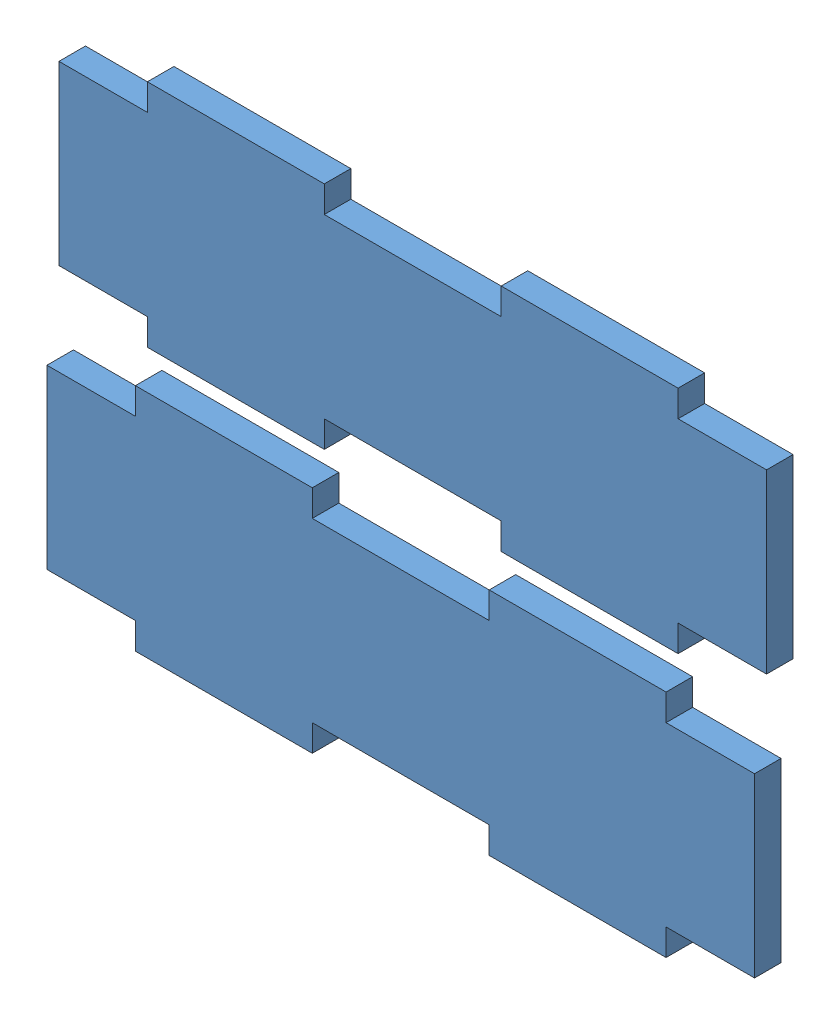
SolidWorks assembly Assem4.SLDASM, configuration Default (file format 9000). Lengths in mm.
Overall size (80.14 54.93 4.5).
2 component instances, 1 part files, 0 mates.
Components (placement in the parent):
- dispenser_stand.p3-1: dispenser_stand.p3.SLDPRT [Default] at (-56.4922 6.279 80) size (80 26 3)
- dispenser_stand.p3-2: dispenser_stand.p3.SLDPRT [Default] at (-56.6344 35.2114 78.5) size (80 26 3)
